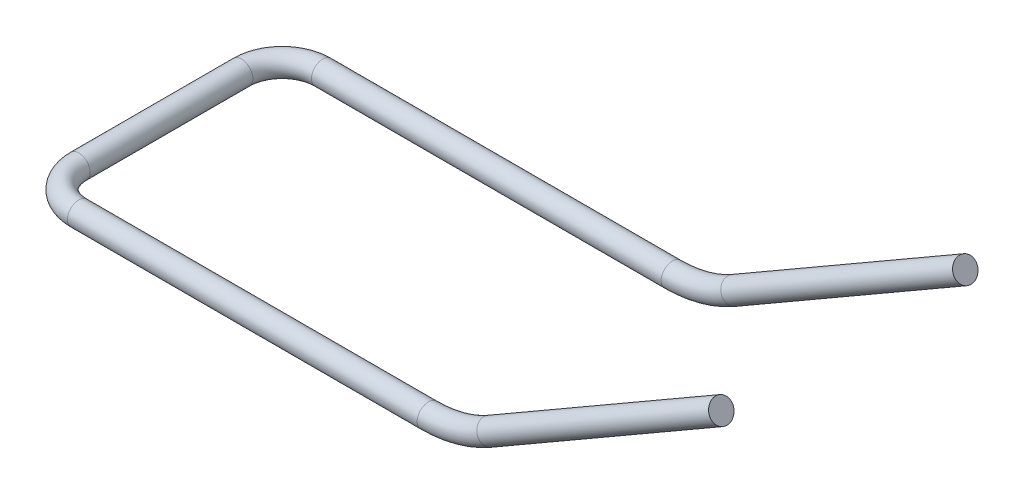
from build123d import *

# Parameters (mm, degrees)
SKETCH3_R = 7


with BuildPart() as part:
    # Sweep1: sweep along a curve in space
    with BuildLine() as sweep1_path:
        Line((420, 92.320508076, -75), (277.5, 10.048094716, -75))
        ThreePointArc((277.5, 10.048094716, -75), (259.411428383, 2.555563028, -75), (240, 0, -75))
        Line((240, 0, -75), (25, 0, -75))
        ThreePointArc((25, 0, -75), (7.32233047, 0, -67.67766953), (0, 0, -50))
        Line((0, 0, -50), (0, 0, 50))
        ThreePointArc((0, 0, 50), (7.32233047, 0, 67.67766953), (25, 0, 75))
        Line((25, 0, 75), (240, 0, 75))
        ThreePointArc((240, 0, 75), (259.411428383, 2.555563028, 75), (277.5, 10.048094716, 75))
        Line((277.5, 10.048094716, 75), (420, 92.320508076, 75))
    # Sketch3 → Sweep1 (sweep)
    with BuildSketch(Plane(origin=(420, 92.320508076, 75), x_dir=(0, 0, -1), z_dir=(0.8660254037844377, 0.5000000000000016, 0))):
        Circle(SKETCH3_R)
    sweep(path=sweep1_path.line)


solid = part.part
